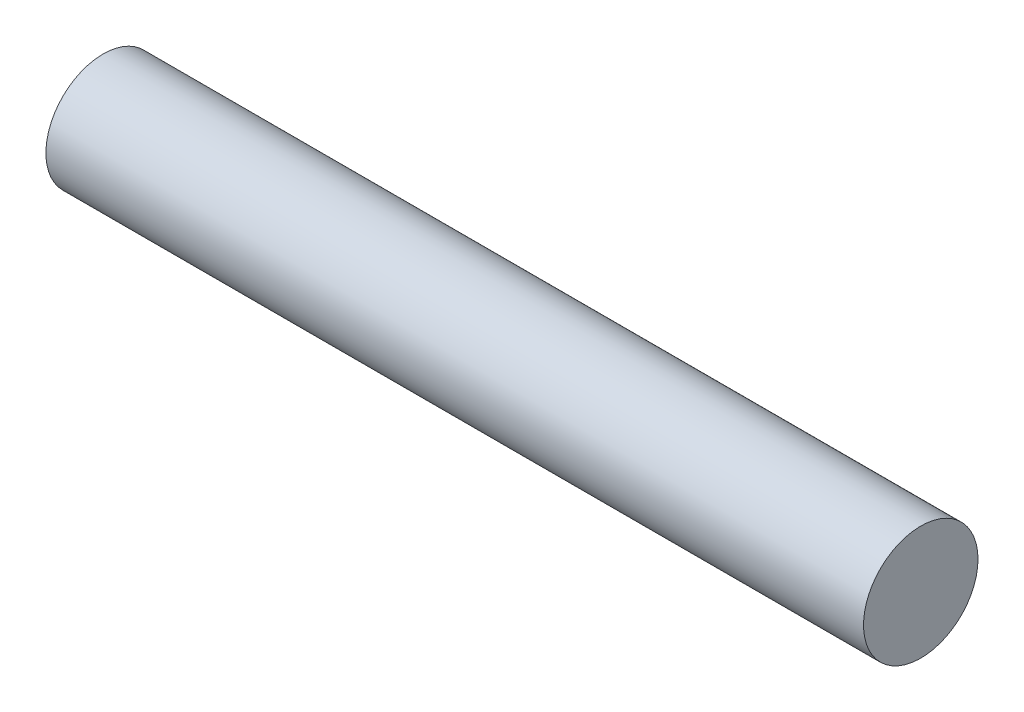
ISO-10303-21;
HEADER;
FILE_DESCRIPTION(('STEP AP214'),'2;1');
FILE_NAME('part.step','',(''),(''),'','','');
FILE_SCHEMA(('AUTOMOTIVE_DESIGN { 1 0 10303 214 1 1 1 1 }'));
ENDSEC;
DATA;
#1=APPLICATION_CONTEXT('core data for automotive mechanical design processes');
#2=APPLICATION_PROTOCOL_DEFINITION('international standard','automotive_design',2000,#1);
#3=PRODUCT_CONTEXT('',#1,'mechanical');
#4=PRODUCT('Part','Part','',(#3));
#5=PRODUCT_RELATED_PRODUCT_CATEGORY('part','',(#4));
#6=PRODUCT_DEFINITION_FORMATION('','',#4);
#7=PRODUCT_DEFINITION_CONTEXT('part definition',#1,'design');
#8=PRODUCT_DEFINITION('design','',#6,#7);
#9=PRODUCT_DEFINITION_SHAPE('','',#8);
#10=(LENGTH_UNIT() NAMED_UNIT(*) SI_UNIT(.MILLI.,.METRE.));
#11=(NAMED_UNIT(*) PLANE_ANGLE_UNIT() SI_UNIT($,.RADIAN.));
#12=(NAMED_UNIT(*) SI_UNIT($,.STERADIAN.) SOLID_ANGLE_UNIT());
#13=UNCERTAINTY_MEASURE_WITH_UNIT(LENGTH_MEASURE(1.E-05),#10,'distance_accuracy_value','');
#14=(GEOMETRIC_REPRESENTATION_CONTEXT(3) GLOBAL_UNCERTAINTY_ASSIGNED_CONTEXT((#13)) GLOBAL_UNIT_ASSIGNED_CONTEXT((#10,
#11,#12)) REPRESENTATION_CONTEXT('',''));
#15=CARTESIAN_POINT('',(0.,0.,0.));
#16=DIRECTION('',(0.,0.,1.));
#17=DIRECTION('',(1.,0.,0.));
#18=AXIS2_PLACEMENT_3D('',#15,#16,#17);
#19=CARTESIAN_POINT('',(300.,0.,0.));
#20=DIRECTION('',(-1.,0.,0.));
#21=DIRECTION('',(0.,0.,1.));
#22=AXIS2_PLACEMENT_3D('',#19,#20,#21);
#23=CYLINDRICAL_SURFACE('',#22,21.);
#24=CARTESIAN_POINT('',(300.,0.,0.));
#25=DIRECTION('',(1.,0.,0.));
#26=DIRECTION('',(0.,0.,-1.));
#27=AXIS2_PLACEMENT_3D('',#24,#25,#26);
#28=CIRCLE('',#27,21.);
#29=CARTESIAN_POINT('',(300.,0.,-21.));
#30=VERTEX_POINT('',#29);
#31=EDGE_CURVE('E10',#30,#30,#28,.T.);
#32=ORIENTED_EDGE('',*,*,#31,.F.);
#33=EDGE_LOOP('',(#32));
#34=FACE_BOUND('',#33,.T.);
#35=CARTESIAN_POINT('',(0.,0.,0.));
#36=DIRECTION('',(1.,0.,0.));
#37=DIRECTION('',(0.,0.,-1.));
#38=AXIS2_PLACEMENT_3D('',#35,#36,#37);
#39=CIRCLE('',#38,21.);
#40=CARTESIAN_POINT('',(0.,0.,-21.));
#41=VERTEX_POINT('',#40);
#42=EDGE_CURVE('E42',#41,#41,#39,.T.);
#43=ORIENTED_EDGE('',*,*,#42,.T.);
#44=EDGE_LOOP('',(#43));
#45=FACE_BOUND('',#44,.T.);
#46=ADVANCED_FACE('F39',(#34,#45),#23,.T.);
#47=CARTESIAN_POINT('',(300.,0.,0.));
#48=DIRECTION('',(1.,0.,0.));
#49=DIRECTION('',(0.,0.,-1.));
#50=AXIS2_PLACEMENT_3D('',#47,#48,#49);
#51=PLANE('',#50);
#52=ORIENTED_EDGE('',*,*,#31,.T.);
#53=EDGE_LOOP('',(#52));
#54=FACE_BOUND('',#53,.T.);
#55=ADVANCED_FACE('F54',(#54),#51,.T.);
#56=CARTESIAN_POINT('',(0.,0.,0.));
#57=DIRECTION('',(1.,0.,0.));
#58=DIRECTION('',(0.,0.,-1.));
#59=AXIS2_PLACEMENT_3D('',#56,#57,#58);
#60=PLANE('',#59);
#61=ORIENTED_EDGE('',*,*,#42,.F.);
#62=EDGE_LOOP('',(#61));
#63=FACE_BOUND('',#62,.T.);
#64=ADVANCED_FACE('F52',(#63),#60,.F.);
#65=CLOSED_SHELL('',(#46,#55,#64));
#66=MANIFOLD_SOLID_BREP('B2',#65);
#67=ADVANCED_BREP_SHAPE_REPRESENTATION('',(#18,#66),#14);
#68=SHAPE_DEFINITION_REPRESENTATION(#9,#67);
ENDSEC;
END-ISO-10303-21;
